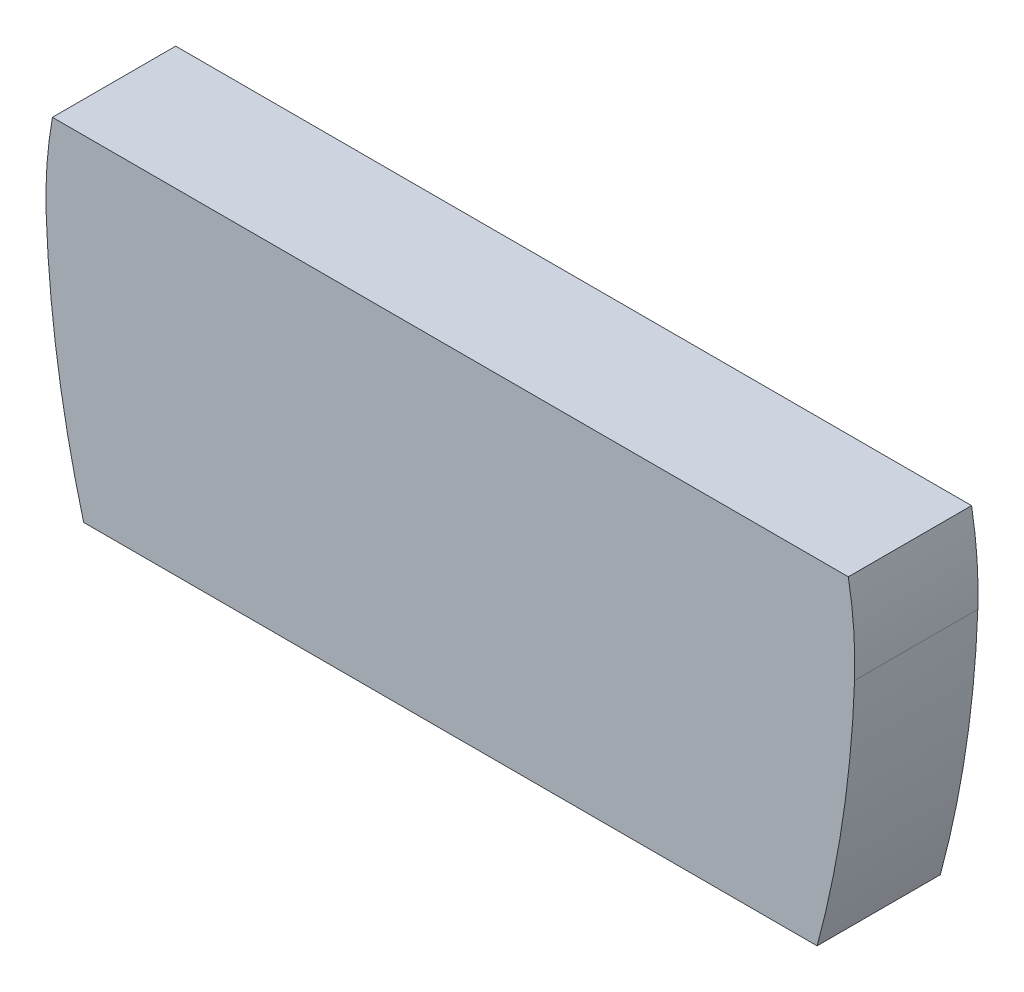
ISO-10303-21;
HEADER;
FILE_DESCRIPTION(('STEP AP214'),'2;1');
FILE_NAME('part.step','',(''),(''),'','','');
FILE_SCHEMA(('AUTOMOTIVE_DESIGN { 1 0 10303 214 1 1 1 1 }'));
ENDSEC;
DATA;
#1=APPLICATION_CONTEXT('core data for automotive mechanical design processes');
#2=APPLICATION_PROTOCOL_DEFINITION('international standard','automotive_design',2000,#1);
#3=PRODUCT_CONTEXT('',#1,'mechanical');
#4=PRODUCT('Part','Part','',(#3));
#5=PRODUCT_RELATED_PRODUCT_CATEGORY('part','',(#4));
#6=PRODUCT_DEFINITION_FORMATION('','',#4);
#7=PRODUCT_DEFINITION_CONTEXT('part definition',#1,'design');
#8=PRODUCT_DEFINITION('design','',#6,#7);
#9=PRODUCT_DEFINITION_SHAPE('','',#8);
#10=(LENGTH_UNIT() NAMED_UNIT(*) SI_UNIT(.MILLI.,.METRE.));
#11=(NAMED_UNIT(*) PLANE_ANGLE_UNIT() SI_UNIT($,.RADIAN.));
#12=(NAMED_UNIT(*) SI_UNIT($,.STERADIAN.) SOLID_ANGLE_UNIT());
#13=UNCERTAINTY_MEASURE_WITH_UNIT(LENGTH_MEASURE(1.E-05),#10,'distance_accuracy_value','');
#14=(GEOMETRIC_REPRESENTATION_CONTEXT(3) GLOBAL_UNCERTAINTY_ASSIGNED_CONTEXT((#13)) GLOBAL_UNIT_ASSIGNED_CONTEXT((#10,
#11,#12)) REPRESENTATION_CONTEXT('',''));
#15=CARTESIAN_POINT('',(0.,0.,0.));
#16=DIRECTION('',(0.,0.,1.));
#17=DIRECTION('',(1.,0.,0.));
#18=AXIS2_PLACEMENT_3D('',#15,#16,#17);
#19=CARTESIAN_POINT('',(0.,34.9116,-113.1976));
#20=DIRECTION('',(0.,0.,1.));
#21=DIRECTION('',(1.,0.,0.));
#22=AXIS2_PLACEMENT_3D('',#19,#20,#21);
#23=CYLINDRICAL_SURFACE('',#22,17.95);
#24=CARTESIAN_POINT('',(0.,34.9116,-107.7276));
#25=DIRECTION('',(0.,0.,1.));
#26=DIRECTION('',(1.,0.,0.));
#27=AXIS2_PLACEMENT_3D('',#24,#25,#26);
#28=CIRCLE('',#27,17.95);
#29=CARTESIAN_POINT('',(-17.6613993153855,38.11745,-107.7276));
#30=VERTEX_POINT('',#29);
#31=CARTESIAN_POINT('',(-17.9384712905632,34.2683677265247,-107.7276));
#32=VERTEX_POINT('',#31);
#33=EDGE_CURVE('E118',#30,#32,#28,.T.);
#34=ORIENTED_EDGE('',*,*,#33,.F.);
#35=DIRECTION('',(0.,0.,1.));
#36=VECTOR('',#35,1.);
#37=CARTESIAN_POINT('',(-17.6613993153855,38.11745,-113.1976));
#38=LINE('',#37,#36);
#39=CARTESIAN_POINT('',(-17.6613993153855,38.11745,-113.1976));
#40=VERTEX_POINT('',#39);
#41=EDGE_CURVE('E11',#40,#30,#38,.T.);
#42=ORIENTED_EDGE('',*,*,#41,.F.);
#43=CARTESIAN_POINT('',(0.,34.9116,-113.1976));
#44=DIRECTION('',(0.,0.,1.));
#45=DIRECTION('',(1.,0.,0.));
#46=AXIS2_PLACEMENT_3D('',#43,#44,#45);
#47=CIRCLE('',#46,17.95);
#48=CARTESIAN_POINT('',(-17.9384712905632,34.2683677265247,-113.1976));
#49=VERTEX_POINT('',#48);
#50=EDGE_CURVE('E132',#40,#49,#47,.T.);
#51=ORIENTED_EDGE('',*,*,#50,.T.);
#52=DIRECTION('',(0.,0.,1.));
#53=VECTOR('',#52,1.);
#54=CARTESIAN_POINT('',(-17.9384712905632,34.2683677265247,-113.1976));
#55=LINE('',#54,#53);
#56=EDGE_CURVE('E36',#49,#32,#55,.T.);
#57=ORIENTED_EDGE('',*,*,#56,.T.);
#58=EDGE_LOOP('',(#34,#42,#51,#57));
#59=FACE_BOUND('',#58,.T.);
#60=ADVANCED_FACE('F33',(#59),#23,.T.);
#61=CARTESIAN_POINT('',(-17.6613993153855,38.11745,-113.1976));
#62=DIRECTION('',(0.,1.,0.));
#63=DIRECTION('',(0.,0.,1.));
#64=AXIS2_PLACEMENT_3D('',#61,#62,#63);
#65=PLANE('',#64);
#66=DIRECTION('',(-1.,0.,0.));
#67=VECTOR('',#66,1.);
#68=CARTESIAN_POINT('',(-17.6613993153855,38.11745,-107.7276));
#69=LINE('',#68,#67);
#70=CARTESIAN_POINT('',(17.6613993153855,38.11745,-107.7276));
#71=VERTEX_POINT('',#70);
#72=EDGE_CURVE('E130',#71,#30,#69,.T.);
#73=ORIENTED_EDGE('',*,*,#72,.F.);
#74=DIRECTION('',(0.,0.,1.));
#75=VECTOR('',#74,1.);
#76=CARTESIAN_POINT('',(17.6613993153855,38.11745,-113.1976));
#77=LINE('',#76,#75);
#78=CARTESIAN_POINT('',(17.6613993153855,38.11745,-113.1976));
#79=VERTEX_POINT('',#78);
#80=EDGE_CURVE('E42',#79,#71,#77,.T.);
#81=ORIENTED_EDGE('',*,*,#80,.F.);
#82=DIRECTION('',(-1.,0.,0.));
#83=VECTOR('',#82,1.);
#84=CARTESIAN_POINT('',(-17.6613993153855,38.11745,-113.1976));
#85=LINE('',#84,#83);
#86=EDGE_CURVE('E108',#79,#40,#85,.T.);
#87=ORIENTED_EDGE('',*,*,#86,.T.);
#88=ORIENTED_EDGE('',*,*,#41,.T.);
#89=EDGE_LOOP('',(#73,#81,#87,#88));
#90=FACE_BOUND('',#89,.T.);
#91=ADVANCED_FACE('F140',(#90),#65,.T.);
#92=CARTESIAN_POINT('',(0.,34.9116,-113.1976));
#93=DIRECTION('',(0.,0.,1.));
#94=DIRECTION('',(1.,0.,0.));
#95=AXIS2_PLACEMENT_3D('',#92,#93,#94);
#96=CYLINDRICAL_SURFACE('',#95,17.95);
#97=CARTESIAN_POINT('',(0.,34.9116,-107.7276));
#98=DIRECTION('',(0.,0.,1.));
#99=DIRECTION('',(1.,0.,0.));
#100=AXIS2_PLACEMENT_3D('',#97,#98,#99);
#101=CIRCLE('',#100,17.95);
#102=CARTESIAN_POINT('',(17.9384712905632,34.2683677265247,-107.7276));
#103=VERTEX_POINT('',#102);
#104=EDGE_CURVE('E95',#103,#71,#101,.T.);
#105=ORIENTED_EDGE('',*,*,#104,.F.);
#106=DIRECTION('',(0.,0.,1.));
#107=VECTOR('',#106,1.);
#108=CARTESIAN_POINT('',(17.9384712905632,34.2683677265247,-113.1976));
#109=LINE('',#108,#107);
#110=CARTESIAN_POINT('',(17.9384712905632,34.2683677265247,-113.1976));
#111=VERTEX_POINT('',#110);
#112=EDGE_CURVE('E90',#111,#103,#109,.T.);
#113=ORIENTED_EDGE('',*,*,#112,.F.);
#114=CARTESIAN_POINT('',(0.,34.9116,-113.1976));
#115=DIRECTION('',(0.,0.,1.));
#116=DIRECTION('',(1.,0.,0.));
#117=AXIS2_PLACEMENT_3D('',#114,#115,#116);
#118=CIRCLE('',#117,17.95);
#119=EDGE_CURVE('E93',#111,#79,#118,.T.);
#120=ORIENTED_EDGE('',*,*,#119,.T.);
#121=ORIENTED_EDGE('',*,*,#80,.T.);
#122=EDGE_LOOP('',(#105,#113,#120,#121));
#123=FACE_BOUND('',#122,.T.);
#124=ADVANCED_FACE('F92',(#123),#96,.T.);
#125=CARTESIAN_POINT('',(-31.1649708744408,36.0291040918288,-113.1976));
#126=DIRECTION('',(0.,0.,1.));
#127=DIRECTION('',(1.,0.,0.));
#128=AXIS2_PLACEMENT_3D('',#125,#126,#127);
#129=CYLINDRICAL_SURFACE('',#128,49.135);
#130=CARTESIAN_POINT('',(-31.1649708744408,36.0291040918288,-107.7276));
#131=DIRECTION('',(0.,0.,1.));
#132=DIRECTION('',(1.,0.,0.));
#133=AXIS2_PLACEMENT_3D('',#130,#131,#132);
#134=CIRCLE('',#133,49.135);
#135=CARTESIAN_POINT('',(16.2759232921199,23.2381,-107.7276));
#136=VERTEX_POINT('',#135);
#137=EDGE_CURVE('E127',#136,#103,#134,.T.);
#138=ORIENTED_EDGE('',*,*,#137,.F.);
#139=DIRECTION('',(0.,0.,1.));
#140=VECTOR('',#139,1.);
#141=CARTESIAN_POINT('',(16.2759232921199,23.2381,-113.1976));
#142=LINE('',#141,#140);
#143=CARTESIAN_POINT('',(16.2759232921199,23.2381,-113.1976));
#144=VERTEX_POINT('',#143);
#145=EDGE_CURVE('E100',#144,#136,#142,.T.);
#146=ORIENTED_EDGE('',*,*,#145,.F.);
#147=CARTESIAN_POINT('',(-31.1649708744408,36.0291040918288,-113.1976));
#148=DIRECTION('',(0.,0.,1.));
#149=DIRECTION('',(1.,0.,0.));
#150=AXIS2_PLACEMENT_3D('',#147,#148,#149);
#151=CIRCLE('',#150,49.135);
#152=EDGE_CURVE('E106',#144,#111,#151,.T.);
#153=ORIENTED_EDGE('',*,*,#152,.T.);
#154=ORIENTED_EDGE('',*,*,#112,.T.);
#155=EDGE_LOOP('',(#138,#146,#153,#154));
#156=FACE_BOUND('',#155,.T.);
#157=ADVANCED_FACE('F110',(#156),#129,.T.);
#158=CARTESIAN_POINT('',(-16.2759232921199,23.2381,-113.1976));
#159=DIRECTION('',(0.,-1.,0.));
#160=DIRECTION('',(0.,0.,-1.));
#161=AXIS2_PLACEMENT_3D('',#158,#159,#160);
#162=PLANE('',#161);
#163=DIRECTION('',(1.,0.,0.));
#164=VECTOR('',#163,1.);
#165=CARTESIAN_POINT('',(-16.2759232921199,23.2381,-107.7276));
#166=LINE('',#165,#164);
#167=CARTESIAN_POINT('',(-16.2759232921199,23.2381,-107.7276));
#168=VERTEX_POINT('',#167);
#169=EDGE_CURVE('E124',#168,#136,#166,.T.);
#170=ORIENTED_EDGE('',*,*,#169,.F.);
#171=DIRECTION('',(0.,0.,1.));
#172=VECTOR('',#171,1.);
#173=CARTESIAN_POINT('',(-16.2759232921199,23.2381,-113.1976));
#174=LINE('',#173,#172);
#175=CARTESIAN_POINT('',(-16.2759232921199,23.2381,-113.1976));
#176=VERTEX_POINT('',#175);
#177=EDGE_CURVE('E135',#176,#168,#174,.T.);
#178=ORIENTED_EDGE('',*,*,#177,.F.);
#179=DIRECTION('',(1.,0.,0.));
#180=VECTOR('',#179,1.);
#181=CARTESIAN_POINT('',(-16.2759232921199,23.2381,-113.1976));
#182=LINE('',#181,#180);
#183=EDGE_CURVE('E111',#176,#144,#182,.T.);
#184=ORIENTED_EDGE('',*,*,#183,.T.);
#185=ORIENTED_EDGE('',*,*,#145,.T.);
#186=EDGE_LOOP('',(#170,#178,#184,#185));
#187=FACE_BOUND('',#186,.T.);
#188=ADVANCED_FACE('F153',(#187),#162,.T.);
#189=CARTESIAN_POINT('',(31.1649708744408,36.0291040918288,-113.1976));
#190=DIRECTION('',(0.,0.,1.));
#191=DIRECTION('',(1.,0.,0.));
#192=AXIS2_PLACEMENT_3D('',#189,#190,#191);
#193=CYLINDRICAL_SURFACE('',#192,49.135);
#194=CARTESIAN_POINT('',(31.1649708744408,36.0291040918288,-107.7276));
#195=DIRECTION('',(0.,0.,1.));
#196=DIRECTION('',(1.,0.,0.));
#197=AXIS2_PLACEMENT_3D('',#194,#195,#196);
#198=CIRCLE('',#197,49.135);
#199=EDGE_CURVE('E121',#32,#168,#198,.T.);
#200=ORIENTED_EDGE('',*,*,#199,.F.);
#201=ORIENTED_EDGE('',*,*,#56,.F.);
#202=CARTESIAN_POINT('',(31.1649708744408,36.0291040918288,-113.1976));
#203=DIRECTION('',(0.,0.,1.));
#204=DIRECTION('',(1.,0.,0.));
#205=AXIS2_PLACEMENT_3D('',#202,#203,#204);
#206=CIRCLE('',#205,49.135);
#207=EDGE_CURVE('E113',#49,#176,#206,.T.);
#208=ORIENTED_EDGE('',*,*,#207,.T.);
#209=ORIENTED_EDGE('',*,*,#177,.T.);
#210=EDGE_LOOP('',(#200,#201,#208,#209));
#211=FACE_BOUND('',#210,.T.);
#212=ADVANCED_FACE('F137',(#211),#193,.T.);
#213=CARTESIAN_POINT('',(0.,34.9116,-113.1976));
#214=DIRECTION('',(0.,0.,1.));
#215=DIRECTION('',(1.,0.,0.));
#216=AXIS2_PLACEMENT_3D('',#213,#214,#215);
#217=PLANE('',#216);
#218=ORIENTED_EDGE('',*,*,#50,.F.);
#219=ORIENTED_EDGE('',*,*,#86,.F.);
#220=ORIENTED_EDGE('',*,*,#119,.F.);
#221=ORIENTED_EDGE('',*,*,#152,.F.);
#222=ORIENTED_EDGE('',*,*,#183,.F.);
#223=ORIENTED_EDGE('',*,*,#207,.F.);
#224=EDGE_LOOP('',(#218,#219,#220,#221,#222,#223));
#225=FACE_BOUND('',#224,.T.);
#226=ADVANCED_FACE('F104',(#225),#217,.F.);
#227=CARTESIAN_POINT('',(0.,34.9116,-107.7276));
#228=DIRECTION('',(0.,0.,1.));
#229=DIRECTION('',(1.,0.,0.));
#230=AXIS2_PLACEMENT_3D('',#227,#228,#229);
#231=PLANE('',#230);
#232=ORIENTED_EDGE('',*,*,#33,.T.);
#233=ORIENTED_EDGE('',*,*,#199,.T.);
#234=ORIENTED_EDGE('',*,*,#169,.T.);
#235=ORIENTED_EDGE('',*,*,#137,.T.);
#236=ORIENTED_EDGE('',*,*,#104,.T.);
#237=ORIENTED_EDGE('',*,*,#72,.T.);
#238=EDGE_LOOP('',(#232,#233,#234,#235,#236,#237));
#239=FACE_BOUND('',#238,.T.);
#240=ADVANCED_FACE('F139',(#239),#231,.T.);
#241=CLOSED_SHELL('',(#60,#91,#124,#157,#188,#212,#226,#240));
#242=MANIFOLD_SOLID_BREP('B2',#241);
#243=ADVANCED_BREP_SHAPE_REPRESENTATION('',(#18,#242),#14);
#244=SHAPE_DEFINITION_REPRESENTATION(#9,#243);
ENDSEC;
END-ISO-10303-21;
